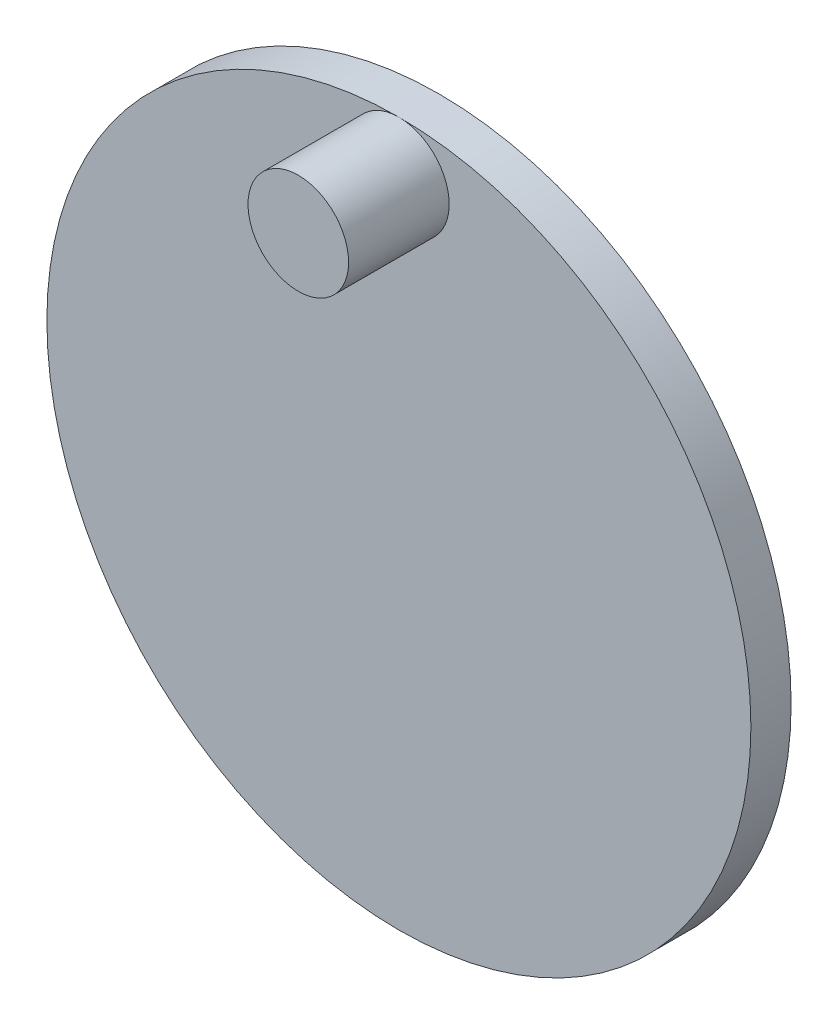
ISO-10303-21;
HEADER;
FILE_DESCRIPTION(('STEP AP214'),'2;1');
FILE_NAME('part.step','',(''),(''),'','','');
FILE_SCHEMA(('AUTOMOTIVE_DESIGN { 1 0 10303 214 1 1 1 1 }'));
ENDSEC;
DATA;
#1=APPLICATION_CONTEXT('core data for automotive mechanical design processes');
#2=APPLICATION_PROTOCOL_DEFINITION('international standard','automotive_design',2000,#1);
#3=PRODUCT_CONTEXT('',#1,'mechanical');
#4=PRODUCT('Part','Part','',(#3));
#5=PRODUCT_RELATED_PRODUCT_CATEGORY('part','',(#4));
#6=PRODUCT_DEFINITION_FORMATION('','',#4);
#7=PRODUCT_DEFINITION_CONTEXT('part definition',#1,'design');
#8=PRODUCT_DEFINITION('design','',#6,#7);
#9=PRODUCT_DEFINITION_SHAPE('','',#8);
#10=(LENGTH_UNIT() NAMED_UNIT(*) SI_UNIT(.MILLI.,.METRE.));
#11=(NAMED_UNIT(*) PLANE_ANGLE_UNIT() SI_UNIT($,.RADIAN.));
#12=(NAMED_UNIT(*) SI_UNIT($,.STERADIAN.) SOLID_ANGLE_UNIT());
#13=UNCERTAINTY_MEASURE_WITH_UNIT(LENGTH_MEASURE(1.E-05),#10,'distance_accuracy_value','');
#14=(GEOMETRIC_REPRESENTATION_CONTEXT(3) GLOBAL_UNCERTAINTY_ASSIGNED_CONTEXT((#13)) GLOBAL_UNIT_ASSIGNED_CONTEXT((#10,
#11,#12)) REPRESENTATION_CONTEXT('',''));
#15=CARTESIAN_POINT('',(0.,0.,0.));
#16=DIRECTION('',(0.,0.,1.));
#17=DIRECTION('',(1.,0.,0.));
#18=AXIS2_PLACEMENT_3D('',#15,#16,#17);
#19=CARTESIAN_POINT('',(0.,0.,2.));
#20=DIRECTION('',(0.,0.,-1.));
#21=DIRECTION('',(-1.,0.,0.));
#22=AXIS2_PLACEMENT_3D('',#19,#20,#21);
#23=CYLINDRICAL_SURFACE('',#22,17.5);
#24=CARTESIAN_POINT('',(0.,0.,2.));
#25=DIRECTION('',(0.,0.,1.));
#26=DIRECTION('',(1.,0.,0.));
#27=AXIS2_PLACEMENT_3D('',#24,#25,#26);
#28=CIRCLE('',#27,17.5);
#29=CARTESIAN_POINT('',(0.,17.5,2.));
#30=VERTEX_POINT('',#29);
#31=EDGE_CURVE('E43',#30,#30,#28,.T.);
#32=ORIENTED_EDGE('',*,*,#31,.F.);
#33=EDGE_LOOP('',(#32));
#34=FACE_BOUND('',#33,.T.);
#35=CARTESIAN_POINT('',(0.,0.,0.));
#36=DIRECTION('',(0.,0.,1.));
#37=DIRECTION('',(1.,0.,0.));
#38=AXIS2_PLACEMENT_3D('',#35,#36,#37);
#39=CIRCLE('',#38,17.5);
#40=CARTESIAN_POINT('',(17.5,0.,0.));
#41=VERTEX_POINT('',#40);
#42=EDGE_CURVE('E80',#41,#41,#39,.T.);
#43=ORIENTED_EDGE('',*,*,#42,.T.);
#44=EDGE_LOOP('',(#43));
#45=FACE_BOUND('',#44,.T.);
#46=ADVANCED_FACE('F36',(#34,#45),#23,.T.);
#47=CARTESIAN_POINT('',(0.,0.,2.));
#48=DIRECTION('',(0.,0.,1.));
#49=DIRECTION('',(1.,0.,0.));
#50=AXIS2_PLACEMENT_3D('',#47,#48,#49);
#51=PLANE('',#50);
#52=ORIENTED_EDGE('',*,*,#31,.T.);
#53=CARTESIAN_POINT('',(0.,15.,2.));
#54=DIRECTION('',(0.,0.,1.));
#55=DIRECTION('',(1.,0.,0.));
#56=AXIS2_PLACEMENT_3D('',#53,#54,#55);
#57=CIRCLE('',#56,2.5);
#58=EDGE_CURVE('E113',#30,#30,#57,.T.);
#59=ORIENTED_EDGE('',*,*,#58,.F.);
#60=EDGE_LOOP('',(#52,#59));
#61=FACE_BOUND('',#60,.T.);
#62=ADVANCED_FACE('F126',(#61),#51,.T.);
#63=CARTESIAN_POINT('',(0.,0.,0.));
#64=DIRECTION('',(0.,0.,1.));
#65=DIRECTION('',(1.,0.,0.));
#66=AXIS2_PLACEMENT_3D('',#63,#64,#65);
#67=PLANE('',#66);
#68=CARTESIAN_POINT('',(0.,0.,0.));
#69=DIRECTION('',(0.,0.,1.));
#70=DIRECTION('',(1.,0.,0.));
#71=AXIS2_PLACEMENT_3D('',#68,#69,#70);
#72=CIRCLE('',#71,3.7);
#73=CARTESIAN_POINT('',(3.7,0.,0.));
#74=VERTEX_POINT('',#73);
#75=EDGE_CURVE('E11',#74,#74,#72,.F.);
#76=ORIENTED_EDGE('',*,*,#75,.F.);
#77=EDGE_LOOP('',(#76));
#78=FACE_BOUND('',#77,.T.);
#79=ORIENTED_EDGE('',*,*,#42,.F.);
#80=EDGE_LOOP('',(#79));
#81=FACE_BOUND('',#80,.T.);
#82=ADVANCED_FACE('F128',(#78,#81),#67,.F.);
#83=CARTESIAN_POINT('',(0.,0.,-8.));
#84=DIRECTION('',(0.,0.,1.));
#85=DIRECTION('',(1.,0.,0.));
#86=AXIS2_PLACEMENT_3D('',#83,#84,#85);
#87=CYLINDRICAL_SURFACE('',#86,2.7);
#88=CARTESIAN_POINT('',(0.,0.,0.));
#89=DIRECTION('',(0.,0.,-1.));
#90=DIRECTION('',(-1.,0.,0.));
#91=AXIS2_PLACEMENT_3D('',#88,#89,#90);
#92=CIRCLE('',#91,2.7);
#93=CARTESIAN_POINT('',(-1.85,-1.96659604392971,0.));
#94=VERTEX_POINT('',#93);
#95=CARTESIAN_POINT('',(-1.85,1.96659604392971,0.));
#96=VERTEX_POINT('',#95);
#97=EDGE_CURVE('E100',#94,#96,#92,.T.);
#98=ORIENTED_EDGE('',*,*,#97,.F.);
#99=DIRECTION('',(0.,0.,1.));
#100=VECTOR('',#99,1.);
#101=CARTESIAN_POINT('',(-1.85,-1.96659604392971,-8.));
#102=LINE('',#101,#100);
#103=CARTESIAN_POINT('',(-1.85,-1.96659604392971,-8.));
#104=VERTEX_POINT('',#103);
#105=EDGE_CURVE('E83',#104,#94,#102,.T.);
#106=ORIENTED_EDGE('',*,*,#105,.F.);
#107=CARTESIAN_POINT('',(0.,0.,-8.));
#108=DIRECTION('',(0.,0.,-1.));
#109=DIRECTION('',(-1.,0.,0.));
#110=AXIS2_PLACEMENT_3D('',#107,#108,#109);
#111=CIRCLE('',#110,2.7);
#112=CARTESIAN_POINT('',(-1.85,1.96659604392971,-8.));
#113=VERTEX_POINT('',#112);
#114=EDGE_CURVE('E98',#104,#113,#111,.T.);
#115=ORIENTED_EDGE('',*,*,#114,.T.);
#116=DIRECTION('',(0.,0.,1.));
#117=VECTOR('',#116,1.);
#118=CARTESIAN_POINT('',(-1.85,1.96659604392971,-8.));
#119=LINE('',#118,#117);
#120=EDGE_CURVE('E91',#113,#96,#119,.T.);
#121=ORIENTED_EDGE('',*,*,#120,.T.);
#122=EDGE_LOOP('',(#98,#106,#115,#121));
#123=FACE_BOUND('',#122,.T.);
#124=ADVANCED_FACE('F134',(#123),#87,.F.);
#125=CARTESIAN_POINT('',(0.,-1.96659604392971,-8.));
#126=DIRECTION('',(0.,1.,0.));
#127=DIRECTION('',(-1.,0.,0.));
#128=AXIS2_PLACEMENT_3D('',#125,#126,#127);
#129=PLANE('',#128);
#130=DIRECTION('',(-1.,0.,0.));
#131=VECTOR('',#130,1.);
#132=CARTESIAN_POINT('',(0.,-1.96659604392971,0.));
#133=LINE('',#132,#131);
#134=CARTESIAN_POINT('',(1.85,-1.96659604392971,0.));
#135=VERTEX_POINT('',#134);
#136=EDGE_CURVE('E50',#135,#94,#133,.T.);
#137=ORIENTED_EDGE('',*,*,#136,.F.);
#138=DIRECTION('',(0.,0.,1.));
#139=VECTOR('',#138,1.);
#140=CARTESIAN_POINT('',(1.85,-1.96659604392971,-8.));
#141=LINE('',#140,#139);
#142=CARTESIAN_POINT('',(1.85,-1.96659604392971,-8.));
#143=VERTEX_POINT('',#142);
#144=EDGE_CURVE('E86',#143,#135,#141,.T.);
#145=ORIENTED_EDGE('',*,*,#144,.F.);
#146=DIRECTION('',(-1.,0.,0.));
#147=VECTOR('',#146,1.);
#148=CARTESIAN_POINT('',(0.,-1.96659604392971,-8.));
#149=LINE('',#148,#147);
#150=EDGE_CURVE('E108',#143,#104,#149,.T.);
#151=ORIENTED_EDGE('',*,*,#150,.T.);
#152=ORIENTED_EDGE('',*,*,#105,.T.);
#153=EDGE_LOOP('',(#137,#145,#151,#152));
#154=FACE_BOUND('',#153,.T.);
#155=ADVANCED_FACE('F137',(#154),#129,.T.);
#156=CARTESIAN_POINT('',(1.85,1.96659604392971,0.));
#157=VERTEX_POINT('',#156);
#158=EDGE_CURVE('E55',#157,#135,#92,.T.);
#159=ORIENTED_EDGE('',*,*,#158,.F.);
#160=DIRECTION('',(0.,0.,1.));
#161=VECTOR('',#160,1.);
#162=CARTESIAN_POINT('',(1.85,1.96659604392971,-8.));
#163=LINE('',#162,#161);
#164=CARTESIAN_POINT('',(1.85,1.96659604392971,-8.));
#165=VERTEX_POINT('',#164);
#166=EDGE_CURVE('E88',#165,#157,#163,.T.);
#167=ORIENTED_EDGE('',*,*,#166,.F.);
#168=EDGE_CURVE('E107',#165,#143,#111,.T.);
#169=ORIENTED_EDGE('',*,*,#168,.T.);
#170=ORIENTED_EDGE('',*,*,#144,.T.);
#171=EDGE_LOOP('',(#159,#167,#169,#170));
#172=FACE_BOUND('',#171,.T.);
#173=ADVANCED_FACE('F140',(#172),#87,.F.);
#174=CARTESIAN_POINT('',(0.,1.96659604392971,-8.));
#175=DIRECTION('',(0.,1.,0.));
#176=DIRECTION('',(-1.,0.,0.));
#177=AXIS2_PLACEMENT_3D('',#174,#175,#176);
#178=PLANE('',#177);
#179=DIRECTION('',(-1.,0.,0.));
#180=VECTOR('',#179,1.);
#181=CARTESIAN_POINT('',(0.,1.96659604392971,0.));
#182=LINE('',#181,#180);
#183=EDGE_CURVE('E95',#157,#96,#182,.T.);
#184=ORIENTED_EDGE('',*,*,#183,.T.);
#185=ORIENTED_EDGE('',*,*,#120,.F.);
#186=DIRECTION('',(-1.,0.,0.));
#187=VECTOR('',#186,1.);
#188=CARTESIAN_POINT('',(0.,1.96659604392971,-8.));
#189=LINE('',#188,#187);
#190=EDGE_CURVE('E105',#165,#113,#189,.T.);
#191=ORIENTED_EDGE('',*,*,#190,.F.);
#192=ORIENTED_EDGE('',*,*,#166,.T.);
#193=EDGE_LOOP('',(#184,#185,#191,#192));
#194=FACE_BOUND('',#193,.T.);
#195=ADVANCED_FACE('F144',(#194),#178,.F.);
#196=CARTESIAN_POINT('',(0.,0.,-8.));
#197=DIRECTION('',(0.,0.,1.));
#198=DIRECTION('',(1.,0.,0.));
#199=AXIS2_PLACEMENT_3D('',#196,#197,#198);
#200=CYLINDRICAL_SURFACE('',#199,3.7);
#201=CARTESIAN_POINT('',(0.,0.,-8.));
#202=DIRECTION('',(0.,0.,-1.));
#203=DIRECTION('',(-1.,0.,0.));
#204=AXIS2_PLACEMENT_3D('',#201,#202,#203);
#205=CIRCLE('',#204,3.7);
#206=CARTESIAN_POINT('',(-3.7,0.,-8.));
#207=VERTEX_POINT('',#206);
#208=EDGE_CURVE('E94',#207,#207,#205,.T.);
#209=ORIENTED_EDGE('',*,*,#208,.F.);
#210=EDGE_LOOP('',(#209));
#211=FACE_BOUND('',#210,.T.);
#212=ORIENTED_EDGE('',*,*,#75,.T.);
#213=EDGE_LOOP('',(#212));
#214=FACE_BOUND('',#213,.T.);
#215=ADVANCED_FACE('F148',(#211,#214),#200,.T.);
#216=CARTESIAN_POINT('',(0.,0.,-8.));
#217=DIRECTION('',(0.,0.,-1.));
#218=DIRECTION('',(-1.,0.,0.));
#219=AXIS2_PLACEMENT_3D('',#216,#217,#218);
#220=PLANE('',#219);
#221=ORIENTED_EDGE('',*,*,#114,.F.);
#222=ORIENTED_EDGE('',*,*,#150,.F.);
#223=ORIENTED_EDGE('',*,*,#168,.F.);
#224=ORIENTED_EDGE('',*,*,#190,.T.);
#225=EDGE_LOOP('',(#221,#222,#223,#224));
#226=FACE_BOUND('',#225,.T.);
#227=ORIENTED_EDGE('',*,*,#208,.T.);
#228=EDGE_LOOP('',(#227));
#229=FACE_BOUND('',#228,.T.);
#230=ADVANCED_FACE('F152',(#226,#229),#220,.T.);
#231=ORIENTED_EDGE('',*,*,#136,.T.);
#232=ORIENTED_EDGE('',*,*,#97,.T.);
#233=ORIENTED_EDGE('',*,*,#183,.F.);
#234=ORIENTED_EDGE('',*,*,#158,.T.);
#235=EDGE_LOOP('',(#231,#232,#233,#234));
#236=FACE_BOUND('',#235,.T.);
#237=ADVANCED_FACE('F124',(#236),#67,.F.);
#238=CARTESIAN_POINT('',(0.,15.,7.));
#239=DIRECTION('',(0.,0.,-1.));
#240=DIRECTION('',(-1.,0.,0.));
#241=AXIS2_PLACEMENT_3D('',#238,#239,#240);
#242=CYLINDRICAL_SURFACE('',#241,2.5);
#243=CARTESIAN_POINT('',(0.,15.,7.));
#244=DIRECTION('',(0.,0.,1.));
#245=DIRECTION('',(1.,0.,0.));
#246=AXIS2_PLACEMENT_3D('',#243,#244,#245);
#247=CIRCLE('',#246,2.5);
#248=CARTESIAN_POINT('',(2.5,15.,7.));
#249=VERTEX_POINT('',#248);
#250=EDGE_CURVE('E102',#249,#249,#247,.T.);
#251=ORIENTED_EDGE('',*,*,#250,.F.);
#252=EDGE_LOOP('',(#251));
#253=FACE_BOUND('',#252,.T.);
#254=ORIENTED_EDGE('',*,*,#58,.T.);
#255=EDGE_LOOP('',(#254));
#256=FACE_BOUND('',#255,.T.);
#257=ADVANCED_FACE('F121',(#253,#256),#242,.T.);
#258=CARTESIAN_POINT('',(0.,15.,7.));
#259=DIRECTION('',(0.,0.,1.));
#260=DIRECTION('',(1.,0.,0.));
#261=AXIS2_PLACEMENT_3D('',#258,#259,#260);
#262=PLANE('',#261);
#263=ORIENTED_EDGE('',*,*,#250,.T.);
#264=EDGE_LOOP('',(#263));
#265=FACE_BOUND('',#264,.T.);
#266=ADVANCED_FACE('F119',(#265),#262,.T.);
#267=CLOSED_SHELL('',(#46,#62,#82,#124,#155,#173,#195,#215,#230,#237,#257,#266));
#268=MANIFOLD_SOLID_BREP('B2',#267);
#269=ADVANCED_BREP_SHAPE_REPRESENTATION('',(#18,#268),#14);
#270=SHAPE_DEFINITION_REPRESENTATION(#9,#269);
ENDSEC;
END-ISO-10303-21;
